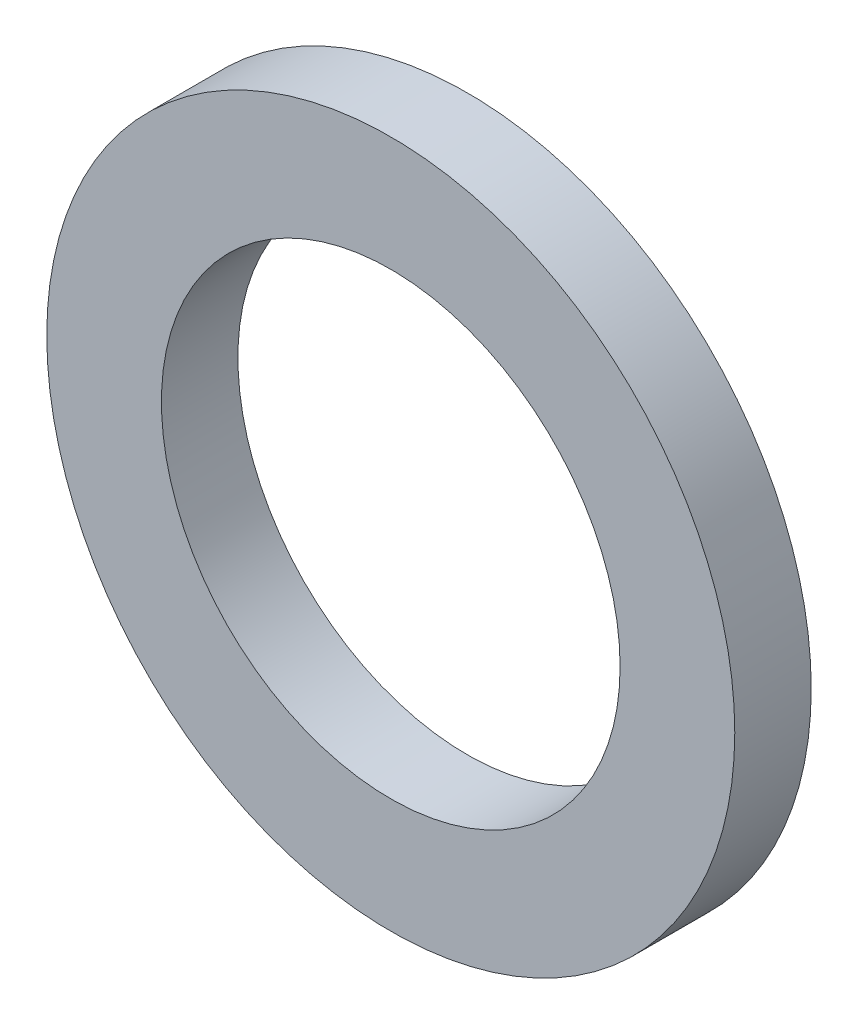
ISO-10303-21;
HEADER;
FILE_DESCRIPTION(('STEP AP214'),'2;1');
FILE_NAME('part.step','',(''),(''),'','','');
FILE_SCHEMA(('AUTOMOTIVE_DESIGN { 1 0 10303 214 1 1 1 1 }'));
ENDSEC;
DATA;
#1=APPLICATION_CONTEXT('core data for automotive mechanical design processes');
#2=APPLICATION_PROTOCOL_DEFINITION('international standard','automotive_design',2000,#1);
#3=PRODUCT_CONTEXT('',#1,'mechanical');
#4=PRODUCT('Part','Part','',(#3));
#5=PRODUCT_RELATED_PRODUCT_CATEGORY('part','',(#4));
#6=PRODUCT_DEFINITION_FORMATION('','',#4);
#7=PRODUCT_DEFINITION_CONTEXT('part definition',#1,'design');
#8=PRODUCT_DEFINITION('design','',#6,#7);
#9=PRODUCT_DEFINITION_SHAPE('','',#8);
#10=(LENGTH_UNIT() NAMED_UNIT(*) SI_UNIT(.MILLI.,.METRE.));
#11=(NAMED_UNIT(*) PLANE_ANGLE_UNIT() SI_UNIT($,.RADIAN.));
#12=(NAMED_UNIT(*) SI_UNIT($,.STERADIAN.) SOLID_ANGLE_UNIT());
#13=UNCERTAINTY_MEASURE_WITH_UNIT(LENGTH_MEASURE(1.E-05),#10,'distance_accuracy_value','');
#14=(GEOMETRIC_REPRESENTATION_CONTEXT(3) GLOBAL_UNCERTAINTY_ASSIGNED_CONTEXT((#13)) GLOBAL_UNIT_ASSIGNED_CONTEXT((#10,
#11,#12)) REPRESENTATION_CONTEXT('',''));
#15=CARTESIAN_POINT('',(0.,0.,0.));
#16=DIRECTION('',(0.,0.,1.));
#17=DIRECTION('',(1.,0.,0.));
#18=AXIS2_PLACEMENT_3D('',#15,#16,#17);
#19=CARTESIAN_POINT('',(0.,0.,10.));
#20=DIRECTION('',(0.,0.,1.));
#21=DIRECTION('',(1.,0.,0.));
#22=AXIS2_PLACEMENT_3D('',#19,#20,#21);
#23=PLANE('',#22);
#24=CARTESIAN_POINT('',(0.,0.,10.));
#25=DIRECTION('',(0.,0.,1.));
#26=DIRECTION('',(1.,0.,0.));
#27=AXIS2_PLACEMENT_3D('',#24,#25,#26);
#28=CIRCLE('',#27,45.);
#29=CARTESIAN_POINT('',(45.,0.,10.));
#30=VERTEX_POINT('',#29);
#31=EDGE_CURVE('E10',#30,#30,#28,.T.);
#32=ORIENTED_EDGE('',*,*,#31,.T.);
#33=EDGE_LOOP('',(#32));
#34=FACE_BOUND('',#33,.T.);
#35=CARTESIAN_POINT('',(0.,0.,10.));
#36=DIRECTION('',(0.,0.,1.));
#37=DIRECTION('',(1.,0.,0.));
#38=AXIS2_PLACEMENT_3D('',#35,#36,#37);
#39=CIRCLE('',#38,30.);
#40=CARTESIAN_POINT('',(30.,0.,10.));
#41=VERTEX_POINT('',#40);
#42=EDGE_CURVE('E40',#41,#41,#39,.T.);
#43=ORIENTED_EDGE('',*,*,#42,.F.);
#44=EDGE_LOOP('',(#43));
#45=FACE_BOUND('',#44,.T.);
#46=ADVANCED_FACE('F29',(#34,#45),#23,.T.);
#47=CARTESIAN_POINT('',(0.,0.,0.));
#48=DIRECTION('',(0.,0.,1.));
#49=DIRECTION('',(1.,0.,0.));
#50=AXIS2_PLACEMENT_3D('',#47,#48,#49);
#51=PLANE('',#50);
#52=CARTESIAN_POINT('',(0.,0.,0.));
#53=DIRECTION('',(0.,0.,1.));
#54=DIRECTION('',(1.,0.,0.));
#55=AXIS2_PLACEMENT_3D('',#52,#53,#54);
#56=CIRCLE('',#55,45.);
#57=CARTESIAN_POINT('',(45.,0.,0.));
#58=VERTEX_POINT('',#57);
#59=EDGE_CURVE('E33',#58,#58,#56,.T.);
#60=ORIENTED_EDGE('',*,*,#59,.F.);
#61=EDGE_LOOP('',(#60));
#62=FACE_BOUND('',#61,.T.);
#63=CARTESIAN_POINT('',(0.,0.,0.));
#64=DIRECTION('',(0.,0.,1.));
#65=DIRECTION('',(1.,0.,0.));
#66=AXIS2_PLACEMENT_3D('',#63,#64,#65);
#67=CIRCLE('',#66,30.);
#68=CARTESIAN_POINT('',(30.,0.,0.));
#69=VERTEX_POINT('',#68);
#70=EDGE_CURVE('E42',#69,#69,#67,.T.);
#71=ORIENTED_EDGE('',*,*,#70,.T.);
#72=EDGE_LOOP('',(#71));
#73=FACE_BOUND('',#72,.T.);
#74=ADVANCED_FACE('F52',(#62,#73),#51,.F.);
#75=CARTESIAN_POINT('',(0.,0.,10.));
#76=DIRECTION('',(0.,0.,-1.));
#77=DIRECTION('',(-1.,0.,0.));
#78=AXIS2_PLACEMENT_3D('',#75,#76,#77);
#79=CYLINDRICAL_SURFACE('',#78,45.);
#80=ORIENTED_EDGE('',*,*,#31,.F.);
#81=EDGE_LOOP('',(#80));
#82=FACE_BOUND('',#81,.T.);
#83=ORIENTED_EDGE('',*,*,#59,.T.);
#84=EDGE_LOOP('',(#83));
#85=FACE_BOUND('',#84,.T.);
#86=ADVANCED_FACE('F31',(#82,#85),#79,.T.);
#87=CARTESIAN_POINT('',(0.,0.,10.));
#88=DIRECTION('',(0.,0.,-1.));
#89=DIRECTION('',(-1.,0.,0.));
#90=AXIS2_PLACEMENT_3D('',#87,#88,#89);
#91=CYLINDRICAL_SURFACE('',#90,30.);
#92=ORIENTED_EDGE('',*,*,#42,.T.);
#93=EDGE_LOOP('',(#92));
#94=FACE_BOUND('',#93,.T.);
#95=ORIENTED_EDGE('',*,*,#70,.F.);
#96=EDGE_LOOP('',(#95));
#97=FACE_BOUND('',#96,.T.);
#98=ADVANCED_FACE('F48',(#94,#97),#91,.F.);
#99=CLOSED_SHELL('',(#46,#74,#86,#98));
#100=MANIFOLD_SOLID_BREP('B2',#99);
#101=ADVANCED_BREP_SHAPE_REPRESENTATION('',(#18,#100),#14);
#102=SHAPE_DEFINITION_REPRESENTATION(#9,#101);
ENDSEC;
END-ISO-10303-21;
